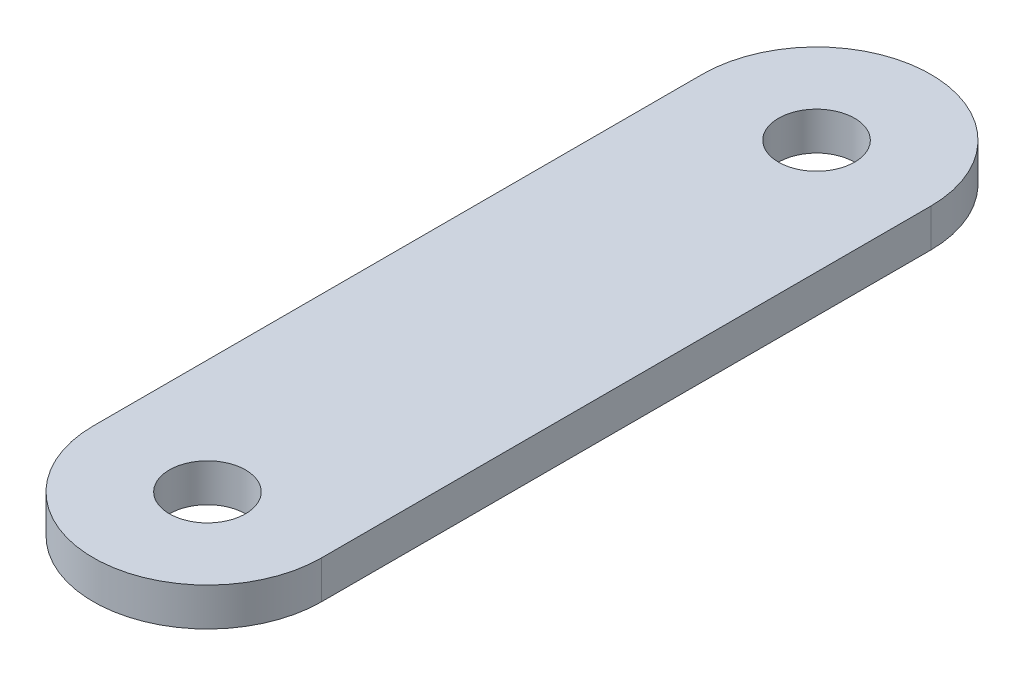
ISO-10303-21;
HEADER;
FILE_DESCRIPTION(('STEP AP214'),'2;1');
FILE_NAME('part.step','',(''),(''),'','','');
FILE_SCHEMA(('AUTOMOTIVE_DESIGN { 1 0 10303 214 1 1 1 1 }'));
ENDSEC;
DATA;
#1=APPLICATION_CONTEXT('core data for automotive mechanical design processes');
#2=APPLICATION_PROTOCOL_DEFINITION('international standard','automotive_design',2000,#1);
#3=PRODUCT_CONTEXT('',#1,'mechanical');
#4=PRODUCT('Part','Part','',(#3));
#5=PRODUCT_RELATED_PRODUCT_CATEGORY('part','',(#4));
#6=PRODUCT_DEFINITION_FORMATION('','',#4);
#7=PRODUCT_DEFINITION_CONTEXT('part definition',#1,'design');
#8=PRODUCT_DEFINITION('design','',#6,#7);
#9=PRODUCT_DEFINITION_SHAPE('','',#8);
#10=(LENGTH_UNIT() NAMED_UNIT(*) SI_UNIT(.MILLI.,.METRE.));
#11=(NAMED_UNIT(*) PLANE_ANGLE_UNIT() SI_UNIT($,.RADIAN.));
#12=(NAMED_UNIT(*) SI_UNIT($,.STERADIAN.) SOLID_ANGLE_UNIT());
#13=UNCERTAINTY_MEASURE_WITH_UNIT(LENGTH_MEASURE(1.E-05),#10,'distance_accuracy_value','');
#14=(GEOMETRIC_REPRESENTATION_CONTEXT(3) GLOBAL_UNCERTAINTY_ASSIGNED_CONTEXT((#13)) GLOBAL_UNIT_ASSIGNED_CONTEXT((#10,
#11,#12)) REPRESENTATION_CONTEXT('',''));
#15=CARTESIAN_POINT('',(0.,0.,0.));
#16=DIRECTION('',(0.,0.,1.));
#17=DIRECTION('',(1.,0.,0.));
#18=AXIS2_PLACEMENT_3D('',#15,#16,#17);
#19=CARTESIAN_POINT('',(0.,1.,-8.));
#20=DIRECTION('',(0.,-1.,0.));
#21=DIRECTION('',(0.,0.,-1.));
#22=AXIS2_PLACEMENT_3D('',#19,#20,#21);
#23=PLANE('',#22);
#24=CARTESIAN_POINT('',(0.,1.,-8.));
#25=DIRECTION('',(0.,1.,0.));
#26=DIRECTION('',(0.,0.,-1.));
#27=AXIS2_PLACEMENT_3D('',#24,#25,#26);
#28=CIRCLE('',#27,3.);
#29=CARTESIAN_POINT('',(3.,1.,-8.));
#30=VERTEX_POINT('',#29);
#31=CARTESIAN_POINT('',(-3.,1.,-8.));
#32=VERTEX_POINT('',#31);
#33=EDGE_CURVE('E87',#30,#32,#28,.T.);
#34=ORIENTED_EDGE('',*,*,#33,.T.);
#35=DIRECTION('',(0.,0.,1.));
#36=VECTOR('',#35,1.);
#37=CARTESIAN_POINT('',(-3.,1.,-8.));
#38=LINE('',#37,#36);
#39=CARTESIAN_POINT('',(-3.,1.,8.));
#40=VERTEX_POINT('',#39);
#41=EDGE_CURVE('E115',#32,#40,#38,.T.);
#42=ORIENTED_EDGE('',*,*,#41,.T.);
#43=CARTESIAN_POINT('',(0.,1.,8.));
#44=DIRECTION('',(0.,-1.,0.));
#45=DIRECTION('',(0.,0.,1.));
#46=AXIS2_PLACEMENT_3D('',#43,#44,#45);
#47=CIRCLE('',#46,3.);
#48=CARTESIAN_POINT('',(3.,1.,8.));
#49=VERTEX_POINT('',#48);
#50=EDGE_CURVE('E94',#49,#40,#47,.T.);
#51=ORIENTED_EDGE('',*,*,#50,.F.);
#52=DIRECTION('',(0.,0.,-1.));
#53=VECTOR('',#52,1.);
#54=CARTESIAN_POINT('',(3.,1.,-8.));
#55=LINE('',#54,#53);
#56=EDGE_CURVE('E54',#49,#30,#55,.T.);
#57=ORIENTED_EDGE('',*,*,#56,.T.);
#58=EDGE_LOOP('',(#34,#42,#51,#57));
#59=FACE_BOUND('',#58,.T.);
#60=CARTESIAN_POINT('',(0.,1.,-8.));
#61=DIRECTION('',(0.,1.,0.));
#62=DIRECTION('',(0.,0.,1.));
#63=AXIS2_PLACEMENT_3D('',#60,#61,#62);
#64=CIRCLE('',#63,1.);
#65=CARTESIAN_POINT('',(0.,1.,-7.));
#66=VERTEX_POINT('',#65);
#67=EDGE_CURVE('E109',#66,#66,#64,.T.);
#68=ORIENTED_EDGE('',*,*,#67,.F.);
#69=EDGE_LOOP('',(#68));
#70=FACE_BOUND('',#69,.T.);
#71=CARTESIAN_POINT('',(0.,1.,8.));
#72=DIRECTION('',(0.,-1.,0.));
#73=DIRECTION('',(0.,0.,-1.));
#74=AXIS2_PLACEMENT_3D('',#71,#72,#73);
#75=CIRCLE('',#74,1.);
#76=CARTESIAN_POINT('',(0.,1.,7.));
#77=VERTEX_POINT('',#76);
#78=EDGE_CURVE('E99',#77,#77,#75,.T.);
#79=ORIENTED_EDGE('',*,*,#78,.T.);
#80=EDGE_LOOP('',(#79));
#81=FACE_BOUND('',#80,.T.);
#82=ADVANCED_FACE('F37',(#59,#70,#81),#23,.F.);
#83=CARTESIAN_POINT('',(0.,0.,-8.));
#84=DIRECTION('',(0.,-1.,0.));
#85=DIRECTION('',(0.,0.,-1.));
#86=AXIS2_PLACEMENT_3D('',#83,#84,#85);
#87=PLANE('',#86);
#88=CARTESIAN_POINT('',(0.,0.,-8.));
#89=DIRECTION('',(0.,1.,0.));
#90=DIRECTION('',(0.,0.,-1.));
#91=AXIS2_PLACEMENT_3D('',#88,#89,#90);
#92=CIRCLE('',#91,3.);
#93=CARTESIAN_POINT('',(3.,0.,-8.));
#94=VERTEX_POINT('',#93);
#95=CARTESIAN_POINT('',(-3.,0.,-8.));
#96=VERTEX_POINT('',#95);
#97=EDGE_CURVE('E85',#94,#96,#92,.T.);
#98=ORIENTED_EDGE('',*,*,#97,.F.);
#99=DIRECTION('',(0.,0.,-1.));
#100=VECTOR('',#99,1.);
#101=CARTESIAN_POINT('',(3.,0.,-8.));
#102=LINE('',#101,#100);
#103=CARTESIAN_POINT('',(3.,0.,8.));
#104=VERTEX_POINT('',#103);
#105=EDGE_CURVE('E79',#104,#94,#102,.T.);
#106=ORIENTED_EDGE('',*,*,#105,.F.);
#107=CARTESIAN_POINT('',(0.,0.,8.));
#108=DIRECTION('',(0.,-1.,0.));
#109=DIRECTION('',(0.,0.,1.));
#110=AXIS2_PLACEMENT_3D('',#107,#108,#109);
#111=CIRCLE('',#110,3.);
#112=CARTESIAN_POINT('',(-3.,0.,8.));
#113=VERTEX_POINT('',#112);
#114=EDGE_CURVE('E83',#104,#113,#111,.T.);
#115=ORIENTED_EDGE('',*,*,#114,.T.);
#116=DIRECTION('',(0.,0.,1.));
#117=VECTOR('',#116,1.);
#118=CARTESIAN_POINT('',(-3.,0.,-8.));
#119=LINE('',#118,#117);
#120=EDGE_CURVE('E66',#96,#113,#119,.T.);
#121=ORIENTED_EDGE('',*,*,#120,.F.);
#122=EDGE_LOOP('',(#98,#106,#115,#121));
#123=FACE_BOUND('',#122,.T.);
#124=CARTESIAN_POINT('',(0.,0.,-8.));
#125=DIRECTION('',(0.,1.,0.));
#126=DIRECTION('',(0.,0.,1.));
#127=AXIS2_PLACEMENT_3D('',#124,#125,#126);
#128=CIRCLE('',#127,1.);
#129=CARTESIAN_POINT('',(0.,0.,-7.));
#130=VERTEX_POINT('',#129);
#131=EDGE_CURVE('E108',#130,#130,#128,.T.);
#132=ORIENTED_EDGE('',*,*,#131,.T.);
#133=EDGE_LOOP('',(#132));
#134=FACE_BOUND('',#133,.T.);
#135=CARTESIAN_POINT('',(0.,0.,8.));
#136=DIRECTION('',(0.,-1.,0.));
#137=DIRECTION('',(0.,0.,-1.));
#138=AXIS2_PLACEMENT_3D('',#135,#136,#137);
#139=CIRCLE('',#138,1.);
#140=CARTESIAN_POINT('',(0.,0.,7.));
#141=VERTEX_POINT('',#140);
#142=EDGE_CURVE('E103',#141,#141,#139,.T.);
#143=ORIENTED_EDGE('',*,*,#142,.F.);
#144=EDGE_LOOP('',(#143));
#145=FACE_BOUND('',#144,.T.);
#146=ADVANCED_FACE('F80',(#123,#134,#145),#87,.T.);
#147=CARTESIAN_POINT('',(0.,1.,-8.));
#148=DIRECTION('',(0.,-1.,0.));
#149=DIRECTION('',(0.,0.,-1.));
#150=AXIS2_PLACEMENT_3D('',#147,#148,#149);
#151=CYLINDRICAL_SURFACE('',#150,3.);
#152=ORIENTED_EDGE('',*,*,#97,.T.);
#153=DIRECTION('',(0.,-1.,0.));
#154=VECTOR('',#153,1.);
#155=CARTESIAN_POINT('',(-3.,1.,-8.));
#156=LINE('',#155,#154);
#157=EDGE_CURVE('E11',#32,#96,#156,.T.);
#158=ORIENTED_EDGE('',*,*,#157,.F.);
#159=ORIENTED_EDGE('',*,*,#33,.F.);
#160=DIRECTION('',(0.,-1.,0.));
#161=VECTOR('',#160,1.);
#162=CARTESIAN_POINT('',(3.,1.,-8.));
#163=LINE('',#162,#161);
#164=EDGE_CURVE('E46',#30,#94,#163,.T.);
#165=ORIENTED_EDGE('',*,*,#164,.T.);
#166=EDGE_LOOP('',(#152,#158,#159,#165));
#167=FACE_BOUND('',#166,.T.);
#168=ADVANCED_FACE('F39',(#167),#151,.T.);
#169=CARTESIAN_POINT('',(-3.,1.,-8.));
#170=DIRECTION('',(1.,0.,0.));
#171=DIRECTION('',(0.,0.,-1.));
#172=AXIS2_PLACEMENT_3D('',#169,#170,#171);
#173=PLANE('',#172);
#174=ORIENTED_EDGE('',*,*,#120,.T.);
#175=DIRECTION('',(0.,-1.,0.));
#176=VECTOR('',#175,1.);
#177=CARTESIAN_POINT('',(-3.,1.,8.));
#178=LINE('',#177,#176);
#179=EDGE_CURVE('E93',#40,#113,#178,.T.);
#180=ORIENTED_EDGE('',*,*,#179,.F.);
#181=ORIENTED_EDGE('',*,*,#41,.F.);
#182=ORIENTED_EDGE('',*,*,#157,.T.);
#183=EDGE_LOOP('',(#174,#180,#181,#182));
#184=FACE_BOUND('',#183,.T.);
#185=ADVANCED_FACE('F124',(#184),#173,.F.);
#186=CARTESIAN_POINT('',(3.,1.,-8.));
#187=DIRECTION('',(-1.,0.,0.));
#188=DIRECTION('',(0.,0.,1.));
#189=AXIS2_PLACEMENT_3D('',#186,#187,#188);
#190=PLANE('',#189);
#191=ORIENTED_EDGE('',*,*,#105,.T.);
#192=ORIENTED_EDGE('',*,*,#164,.F.);
#193=ORIENTED_EDGE('',*,*,#56,.F.);
#194=DIRECTION('',(0.,-1.,0.));
#195=VECTOR('',#194,1.);
#196=CARTESIAN_POINT('',(3.,1.,8.));
#197=LINE('',#196,#195);
#198=EDGE_CURVE('E89',#49,#104,#197,.T.);
#199=ORIENTED_EDGE('',*,*,#198,.T.);
#200=EDGE_LOOP('',(#191,#192,#193,#199));
#201=FACE_BOUND('',#200,.T.);
#202=ADVANCED_FACE('F90',(#201),#190,.F.);
#203=CARTESIAN_POINT('',(0.,1.,-8.));
#204=DIRECTION('',(0.,-1.,0.));
#205=DIRECTION('',(0.,0.,-1.));
#206=AXIS2_PLACEMENT_3D('',#203,#204,#205);
#207=CYLINDRICAL_SURFACE('',#206,1.);
#208=ORIENTED_EDGE('',*,*,#67,.T.);
#209=EDGE_LOOP('',(#208));
#210=FACE_BOUND('',#209,.T.);
#211=ORIENTED_EDGE('',*,*,#131,.F.);
#212=EDGE_LOOP('',(#211));
#213=FACE_BOUND('',#212,.T.);
#214=ADVANCED_FACE('F130',(#210,#213),#207,.F.);
#215=CARTESIAN_POINT('',(0.,1.,8.));
#216=DIRECTION('',(0.,-1.,0.));
#217=DIRECTION('',(0.,0.,1.));
#218=AXIS2_PLACEMENT_3D('',#215,#216,#217);
#219=CYLINDRICAL_SURFACE('',#218,3.);
#220=ORIENTED_EDGE('',*,*,#114,.F.);
#221=ORIENTED_EDGE('',*,*,#198,.F.);
#222=ORIENTED_EDGE('',*,*,#50,.T.);
#223=ORIENTED_EDGE('',*,*,#179,.T.);
#224=EDGE_LOOP('',(#220,#221,#222,#223));
#225=FACE_BOUND('',#224,.T.);
#226=ADVANCED_FACE('F97',(#225),#219,.T.);
#227=CARTESIAN_POINT('',(0.,1.,8.));
#228=DIRECTION('',(0.,-1.,0.));
#229=DIRECTION('',(0.,0.,1.));
#230=AXIS2_PLACEMENT_3D('',#227,#228,#229);
#231=CYLINDRICAL_SURFACE('',#230,1.);
#232=ORIENTED_EDGE('',*,*,#78,.F.);
#233=EDGE_LOOP('',(#232));
#234=FACE_BOUND('',#233,.T.);
#235=ORIENTED_EDGE('',*,*,#142,.T.);
#236=EDGE_LOOP('',(#235));
#237=FACE_BOUND('',#236,.T.);
#238=ADVANCED_FACE('F144',(#234,#237),#231,.F.);
#239=CLOSED_SHELL('',(#82,#146,#168,#185,#202,#214,#226,#238));
#240=MANIFOLD_SOLID_BREP('B2',#239);
#241=ADVANCED_BREP_SHAPE_REPRESENTATION('',(#18,#240),#14);
#242=SHAPE_DEFINITION_REPRESENTATION(#9,#241);
ENDSEC;
END-ISO-10303-21;
